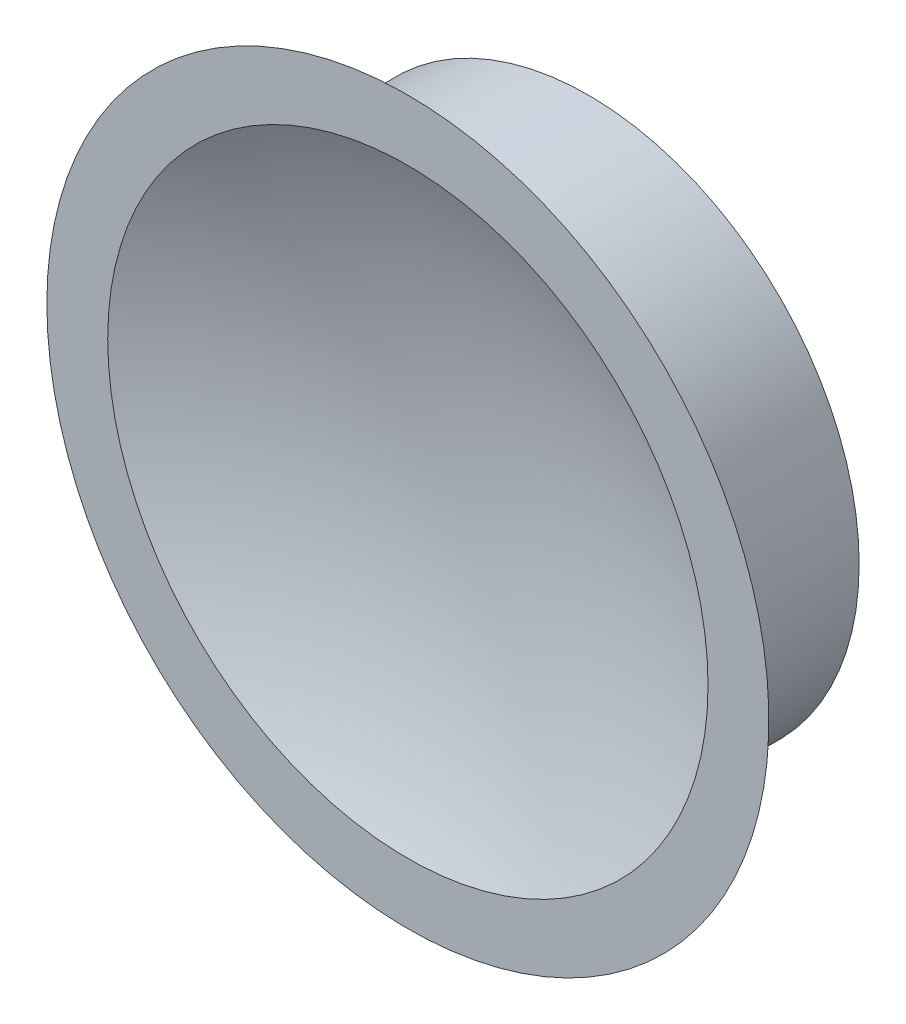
from build123d import *


with BuildPart() as part:
    # Sketch1 → Revolve3 (revolve)
    with BuildSketch(Plane(origin=(0, 0, 0), x_dir=(1, 0, 0), z_dir=(0, 1, 0))):
        with BuildLine():
            Line((3.175, 6.35), (3.175, 1.54938494))
            ThreePointArc((3.175, 1.54938494), (1.560529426, 0.829960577), (0, 0))
            Line((0, 0), (2.141117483, 0))
            ThreePointArc((2.141117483, 0), (7.285570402, 1.794632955), (12.7, 2.402954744))
            Line((12.7, 2.402954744), (12.7, 6.35))
            Line((12.7, 6.35), (3.175, 6.35))
        make_face()
    revolve(axis=Axis((12.7, 0, 0), (0, 0, -1)))


solid = part.part
